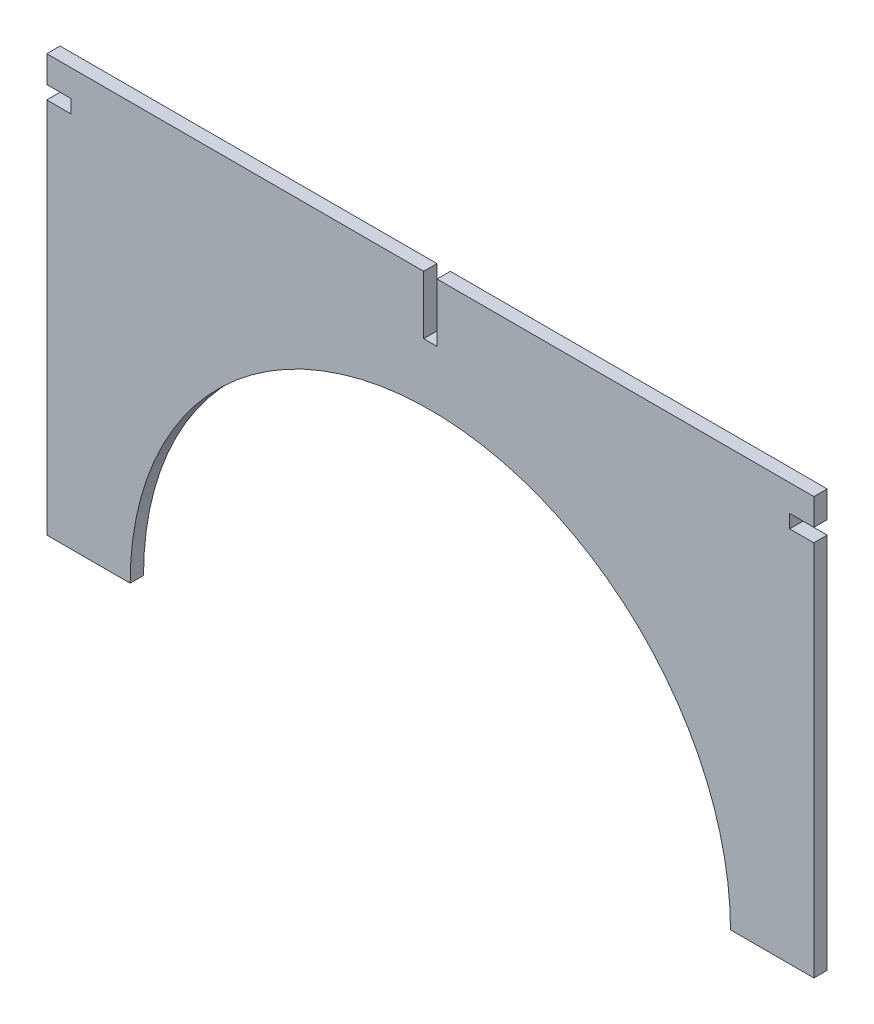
ISO-10303-21;
HEADER;
FILE_DESCRIPTION(('STEP AP214'),'2;1');
FILE_NAME('part.step','',(''),(''),'','','');
FILE_SCHEMA(('AUTOMOTIVE_DESIGN { 1 0 10303 214 1 1 1 1 }'));
ENDSEC;
DATA;
#1=APPLICATION_CONTEXT('core data for automotive mechanical design processes');
#2=APPLICATION_PROTOCOL_DEFINITION('international standard','automotive_design',2000,#1);
#3=PRODUCT_CONTEXT('',#1,'mechanical');
#4=PRODUCT('Part','Part','',(#3));
#5=PRODUCT_RELATED_PRODUCT_CATEGORY('part','',(#4));
#6=PRODUCT_DEFINITION_FORMATION('','',#4);
#7=PRODUCT_DEFINITION_CONTEXT('part definition',#1,'design');
#8=PRODUCT_DEFINITION('design','',#6,#7);
#9=PRODUCT_DEFINITION_SHAPE('','',#8);
#10=(LENGTH_UNIT() NAMED_UNIT(*) SI_UNIT(.MILLI.,.METRE.));
#11=(NAMED_UNIT(*) PLANE_ANGLE_UNIT() SI_UNIT($,.RADIAN.));
#12=(NAMED_UNIT(*) SI_UNIT($,.STERADIAN.) SOLID_ANGLE_UNIT());
#13=UNCERTAINTY_MEASURE_WITH_UNIT(LENGTH_MEASURE(1.E-05),#10,'distance_accuracy_value','');
#14=(GEOMETRIC_REPRESENTATION_CONTEXT(3) GLOBAL_UNCERTAINTY_ASSIGNED_CONTEXT((#13)) GLOBAL_UNIT_ASSIGNED_CONTEXT((#10,
#11,#12)) REPRESENTATION_CONTEXT('',''));
#15=CARTESIAN_POINT('',(0.,0.,0.));
#16=DIRECTION('',(0.,0.,1.));
#17=DIRECTION('',(1.,0.,0.));
#18=AXIS2_PLACEMENT_3D('',#15,#16,#17);
#19=CARTESIAN_POINT('',(0.,0.,16.));
#20=DIRECTION('',(0.,0.,1.));
#21=DIRECTION('',(1.,0.,0.));
#22=AXIS2_PLACEMENT_3D('',#19,#20,#21);
#23=PLANE('',#22);
#24=DIRECTION('',(0.,-1.,0.));
#25=VECTOR('',#24,1.);
#26=CARTESIAN_POINT('',(490.926217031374,0.,16.));
#27=LINE('',#26,#25);
#28=CARTESIAN_POINT('',(490.926217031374,92.,16.));
#29=VERTEX_POINT('',#28);
#30=CARTESIAN_POINT('',(490.926217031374,-360.,16.));
#31=VERTEX_POINT('',#30);
#32=EDGE_CURVE('E182',#29,#31,#27,.T.);
#33=ORIENTED_EDGE('',*,*,#32,.F.);
#34=DIRECTION('',(1.,0.,0.));
#35=VECTOR('',#34,1.);
#36=CARTESIAN_POINT('',(490.926217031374,92.,16.));
#37=LINE('',#36,#35);
#38=CARTESIAN_POINT('',(461.926217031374,92.,16.));
#39=VERTEX_POINT('',#38);
#40=EDGE_CURVE('E171',#39,#29,#37,.T.);
#41=ORIENTED_EDGE('',*,*,#40,.F.);
#42=DIRECTION('',(0.,-1.,0.));
#43=VECTOR('',#42,1.);
#44=CARTESIAN_POINT('',(461.926217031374,108.,16.));
#45=LINE('',#44,#43);
#46=CARTESIAN_POINT('',(461.926217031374,108.,16.));
#47=VERTEX_POINT('',#46);
#48=EDGE_CURVE('E161',#47,#39,#45,.T.);
#49=ORIENTED_EDGE('',*,*,#48,.F.);
#50=DIRECTION('',(-1.,0.,0.));
#51=VECTOR('',#50,1.);
#52=CARTESIAN_POINT('',(490.926217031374,108.,16.));
#53=LINE('',#52,#51);
#54=CARTESIAN_POINT('',(490.926217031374,108.,16.));
#55=VERTEX_POINT('',#54);
#56=EDGE_CURVE('E183',#55,#47,#53,.T.);
#57=ORIENTED_EDGE('',*,*,#56,.F.);
#58=CARTESIAN_POINT('',(490.926217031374,140.,16.));
#59=VERTEX_POINT('',#58);
#60=EDGE_CURVE('E225',#59,#55,#27,.T.);
#61=ORIENTED_EDGE('',*,*,#60,.F.);
#62=DIRECTION('',(-1.,0.,0.));
#63=VECTOR('',#62,1.);
#64=CARTESIAN_POINT('',(0.,140.,16.));
#65=LINE('',#64,#63);
#66=CARTESIAN_POINT('',(38.9262170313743,140.,16.));
#67=VERTEX_POINT('',#66);
#68=EDGE_CURVE('E228',#59,#67,#65,.T.);
#69=ORIENTED_EDGE('',*,*,#68,.T.);
#70=DIRECTION('',(0.,1.,0.));
#71=VECTOR('',#70,1.);
#72=CARTESIAN_POINT('',(38.9262170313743,0.,16.));
#73=LINE('',#72,#71);
#74=CARTESIAN_POINT('',(38.9262170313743,70.,16.));
#75=VERTEX_POINT('',#74);
#76=EDGE_CURVE('E230',#75,#67,#73,.T.);
#77=ORIENTED_EDGE('',*,*,#76,.F.);
#78=DIRECTION('',(1.,0.,0.));
#79=VECTOR('',#78,1.);
#80=CARTESIAN_POINT('',(0.,70.,16.));
#81=LINE('',#80,#79);
#82=CARTESIAN_POINT('',(22.9262170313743,70.,16.));
#83=VERTEX_POINT('',#82);
#84=EDGE_CURVE('E234',#83,#75,#81,.T.);
#85=ORIENTED_EDGE('',*,*,#84,.F.);
#86=DIRECTION('',(0.,1.,0.));
#87=VECTOR('',#86,1.);
#88=CARTESIAN_POINT('',(22.9262170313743,0.,16.));
#89=LINE('',#88,#87);
#90=CARTESIAN_POINT('',(22.9262170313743,140.,16.));
#91=VERTEX_POINT('',#90);
#92=EDGE_CURVE('E237',#83,#91,#89,.T.);
#93=ORIENTED_EDGE('',*,*,#92,.T.);
#94=CARTESIAN_POINT('',(-429.073782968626,140.,16.));
#95=VERTEX_POINT('',#94);
#96=EDGE_CURVE('E231',#91,#95,#65,.T.);
#97=ORIENTED_EDGE('',*,*,#96,.T.);
#98=DIRECTION('',(0.,-1.,0.));
#99=VECTOR('',#98,1.);
#100=CARTESIAN_POINT('',(-429.073782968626,0.,16.));
#101=LINE('',#100,#99);
#102=CARTESIAN_POINT('',(-429.073782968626,108.,16.));
#103=VERTEX_POINT('',#102);
#104=EDGE_CURVE('E239',#95,#103,#101,.T.);
#105=ORIENTED_EDGE('',*,*,#104,.T.);
#106=DIRECTION('',(-1.,0.,0.));
#107=VECTOR('',#106,1.);
#108=CARTESIAN_POINT('',(-429.073782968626,108.,16.));
#109=LINE('',#108,#107);
#110=CARTESIAN_POINT('',(-400.073782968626,108.,16.));
#111=VERTEX_POINT('',#110);
#112=EDGE_CURVE('E197',#111,#103,#109,.T.);
#113=ORIENTED_EDGE('',*,*,#112,.F.);
#114=DIRECTION('',(0.,1.,0.));
#115=VECTOR('',#114,1.);
#116=CARTESIAN_POINT('',(-400.073782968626,108.,16.));
#117=LINE('',#116,#115);
#118=CARTESIAN_POINT('',(-400.073782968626,92.,16.));
#119=VERTEX_POINT('',#118);
#120=EDGE_CURVE('E195',#119,#111,#117,.T.);
#121=ORIENTED_EDGE('',*,*,#120,.F.);
#122=DIRECTION('',(1.,0.,0.));
#123=VECTOR('',#122,1.);
#124=CARTESIAN_POINT('',(-429.073782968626,92.,16.));
#125=LINE('',#124,#123);
#126=CARTESIAN_POINT('',(-429.073782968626,92.,16.));
#127=VERTEX_POINT('',#126);
#128=EDGE_CURVE('E200',#127,#119,#125,.T.);
#129=ORIENTED_EDGE('',*,*,#128,.F.);
#130=CARTESIAN_POINT('',(-429.073782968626,-360.,16.));
#131=VERTEX_POINT('',#130);
#132=EDGE_CURVE('E243',#127,#131,#101,.T.);
#133=ORIENTED_EDGE('',*,*,#132,.T.);
#134=DIRECTION('',(-1.,0.,0.));
#135=VECTOR('',#134,1.);
#136=CARTESIAN_POINT('',(3.99680288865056E-13,-360.,16.));
#137=LINE('',#136,#135);
#138=CARTESIAN_POINT('',(-329.073782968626,-360.,16.));
#139=VERTEX_POINT('',#138);
#140=EDGE_CURVE('E242',#139,#131,#137,.T.);
#141=ORIENTED_EDGE('',*,*,#140,.F.);
#142=CARTESIAN_POINT('',(30.9262170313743,-360.,16.));
#143=DIRECTION('',(0.,0.,1.));
#144=DIRECTION('',(1.,0.,0.));
#145=AXIS2_PLACEMENT_3D('',#142,#143,#144);
#146=CIRCLE('',#145,360.);
#147=CARTESIAN_POINT('',(390.926217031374,-360.,16.));
#148=VERTEX_POINT('',#147);
#149=EDGE_CURVE('E218',#148,#139,#146,.T.);
#150=ORIENTED_EDGE('',*,*,#149,.F.);
#151=DIRECTION('',(-1.,0.,0.));
#152=VECTOR('',#151,1.);
#153=CARTESIAN_POINT('',(1.99840144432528E-13,-360.,16.));
#154=LINE('',#153,#152);
#155=EDGE_CURVE('E221',#31,#148,#154,.T.);
#156=ORIENTED_EDGE('',*,*,#155,.F.);
#157=EDGE_LOOP('',(#33,#41,#49,#57,#61,#69,#77,#85,#93,#97,#105,#113,#121,#129,#133,#141,#150,#156));
#158=FACE_BOUND('',#157,.T.);
#159=ADVANCED_FACE('F34',(#158),#23,.T.);
#160=CARTESIAN_POINT('',(0.,0.,0.));
#161=DIRECTION('',(0.,0.,1.));
#162=DIRECTION('',(1.,0.,0.));
#163=AXIS2_PLACEMENT_3D('',#160,#161,#162);
#164=PLANE('',#163);
#165=DIRECTION('',(1.,0.,0.));
#166=VECTOR('',#165,1.);
#167=CARTESIAN_POINT('',(490.926217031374,92.,0.));
#168=LINE('',#167,#166);
#169=CARTESIAN_POINT('',(461.926217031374,92.,0.));
#170=VERTEX_POINT('',#169);
#171=CARTESIAN_POINT('',(490.926217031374,92.,0.));
#172=VERTEX_POINT('',#171);
#173=EDGE_CURVE('E177',#170,#172,#168,.T.);
#174=ORIENTED_EDGE('',*,*,#173,.T.);
#175=DIRECTION('',(0.,-1.,0.));
#176=VECTOR('',#175,1.);
#177=CARTESIAN_POINT('',(490.926217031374,0.,0.));
#178=LINE('',#177,#176);
#179=CARTESIAN_POINT('',(490.926217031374,-360.,0.));
#180=VERTEX_POINT('',#179);
#181=EDGE_CURVE('E252',#172,#180,#178,.T.);
#182=ORIENTED_EDGE('',*,*,#181,.T.);
#183=DIRECTION('',(-1.,0.,0.));
#184=VECTOR('',#183,1.);
#185=CARTESIAN_POINT('',(1.99840144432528E-13,-360.,0.));
#186=LINE('',#185,#184);
#187=CARTESIAN_POINT('',(390.926217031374,-360.,0.));
#188=VERTEX_POINT('',#187);
#189=EDGE_CURVE('E249',#180,#188,#186,.T.);
#190=ORIENTED_EDGE('',*,*,#189,.T.);
#191=CARTESIAN_POINT('',(30.9262170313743,-360.,0.));
#192=DIRECTION('',(0.,0.,1.));
#193=DIRECTION('',(1.,0.,0.));
#194=AXIS2_PLACEMENT_3D('',#191,#192,#193);
#195=CIRCLE('',#194,360.);
#196=CARTESIAN_POINT('',(-329.073782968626,-360.,0.));
#197=VERTEX_POINT('',#196);
#198=EDGE_CURVE('E217',#188,#197,#195,.T.);
#199=ORIENTED_EDGE('',*,*,#198,.T.);
#200=DIRECTION('',(-1.,0.,0.));
#201=VECTOR('',#200,1.);
#202=CARTESIAN_POINT('',(3.99680288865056E-13,-360.,0.));
#203=LINE('',#202,#201);
#204=CARTESIAN_POINT('',(-429.073782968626,-360.,0.));
#205=VERTEX_POINT('',#204);
#206=EDGE_CURVE('E222',#197,#205,#203,.T.);
#207=ORIENTED_EDGE('',*,*,#206,.T.);
#208=DIRECTION('',(0.,-1.,0.));
#209=VECTOR('',#208,1.);
#210=CARTESIAN_POINT('',(-429.073782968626,0.,0.));
#211=LINE('',#210,#209);
#212=CARTESIAN_POINT('',(-429.073782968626,92.,0.));
#213=VERTEX_POINT('',#212);
#214=EDGE_CURVE('E271',#213,#205,#211,.T.);
#215=ORIENTED_EDGE('',*,*,#214,.F.);
#216=DIRECTION('',(1.,0.,0.));
#217=VECTOR('',#216,1.);
#218=CARTESIAN_POINT('',(-429.073782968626,92.,0.));
#219=LINE('',#218,#217);
#220=CARTESIAN_POINT('',(-400.073782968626,92.,0.));
#221=VERTEX_POINT('',#220);
#222=EDGE_CURVE('E198',#213,#221,#219,.T.);
#223=ORIENTED_EDGE('',*,*,#222,.T.);
#224=DIRECTION('',(0.,1.,0.));
#225=VECTOR('',#224,1.);
#226=CARTESIAN_POINT('',(-400.073782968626,108.,0.));
#227=LINE('',#226,#225);
#228=CARTESIAN_POINT('',(-400.073782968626,108.,0.));
#229=VERTEX_POINT('',#228);
#230=EDGE_CURVE('E57',#221,#229,#227,.T.);
#231=ORIENTED_EDGE('',*,*,#230,.T.);
#232=DIRECTION('',(-1.,0.,0.));
#233=VECTOR('',#232,1.);
#234=CARTESIAN_POINT('',(-429.073782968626,108.,0.));
#235=LINE('',#234,#233);
#236=CARTESIAN_POINT('',(-429.073782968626,108.,0.));
#237=VERTEX_POINT('',#236);
#238=EDGE_CURVE('E204',#229,#237,#235,.T.);
#239=ORIENTED_EDGE('',*,*,#238,.T.);
#240=CARTESIAN_POINT('',(-429.073782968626,140.,0.));
#241=VERTEX_POINT('',#240);
#242=EDGE_CURVE('E268',#241,#237,#211,.T.);
#243=ORIENTED_EDGE('',*,*,#242,.F.);
#244=DIRECTION('',(-1.,0.,0.));
#245=VECTOR('',#244,1.);
#246=CARTESIAN_POINT('',(0.,140.,0.));
#247=LINE('',#246,#245);
#248=CARTESIAN_POINT('',(22.9262170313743,140.,0.));
#249=VERTEX_POINT('',#248);
#250=EDGE_CURVE('E260',#249,#241,#247,.T.);
#251=ORIENTED_EDGE('',*,*,#250,.F.);
#252=DIRECTION('',(0.,1.,0.));
#253=VECTOR('',#252,1.);
#254=CARTESIAN_POINT('',(22.9262170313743,0.,0.));
#255=LINE('',#254,#253);
#256=CARTESIAN_POINT('',(22.9262170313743,70.,0.));
#257=VERTEX_POINT('',#256);
#258=EDGE_CURVE('E266',#257,#249,#255,.T.);
#259=ORIENTED_EDGE('',*,*,#258,.F.);
#260=DIRECTION('',(1.,0.,0.));
#261=VECTOR('',#260,1.);
#262=CARTESIAN_POINT('',(0.,70.,0.));
#263=LINE('',#262,#261);
#264=CARTESIAN_POINT('',(38.9262170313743,70.,0.));
#265=VERTEX_POINT('',#264);
#266=EDGE_CURVE('E263',#257,#265,#263,.T.);
#267=ORIENTED_EDGE('',*,*,#266,.T.);
#268=DIRECTION('',(0.,1.,0.));
#269=VECTOR('',#268,1.);
#270=CARTESIAN_POINT('',(38.9262170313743,0.,0.));
#271=LINE('',#270,#269);
#272=CARTESIAN_POINT('',(38.9262170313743,140.,0.));
#273=VERTEX_POINT('',#272);
#274=EDGE_CURVE('E259',#265,#273,#271,.T.);
#275=ORIENTED_EDGE('',*,*,#274,.T.);
#276=CARTESIAN_POINT('',(490.926217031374,140.,0.));
#277=VERTEX_POINT('',#276);
#278=EDGE_CURVE('E256',#277,#273,#247,.T.);
#279=ORIENTED_EDGE('',*,*,#278,.F.);
#280=CARTESIAN_POINT('',(490.926217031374,108.,0.));
#281=VERTEX_POINT('',#280);
#282=EDGE_CURVE('E253',#277,#281,#178,.T.);
#283=ORIENTED_EDGE('',*,*,#282,.T.);
#284=DIRECTION('',(-1.,0.,0.));
#285=VECTOR('',#284,1.);
#286=CARTESIAN_POINT('',(490.926217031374,108.,0.));
#287=LINE('',#286,#285);
#288=CARTESIAN_POINT('',(461.926217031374,108.,0.));
#289=VERTEX_POINT('',#288);
#290=EDGE_CURVE('E49',#281,#289,#287,.T.);
#291=ORIENTED_EDGE('',*,*,#290,.T.);
#292=DIRECTION('',(0.,-1.,0.));
#293=VECTOR('',#292,1.);
#294=CARTESIAN_POINT('',(461.926217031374,108.,0.));
#295=LINE('',#294,#293);
#296=EDGE_CURVE('E187',#289,#170,#295,.T.);
#297=ORIENTED_EDGE('',*,*,#296,.T.);
#298=EDGE_LOOP('',(#174,#182,#190,#199,#207,#215,#223,#231,#239,#243,#251,#259,#267,#275,#279,
#283,#291,#297));
#299=FACE_BOUND('',#298,.T.);
#300=ADVANCED_FACE('F301',(#299),#164,.F.);
#301=CARTESIAN_POINT('',(490.926217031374,0.,16.));
#302=DIRECTION('',(1.,0.,0.));
#303=DIRECTION('',(0.,1.,0.));
#304=AXIS2_PLACEMENT_3D('',#301,#302,#303);
#305=PLANE('',#304);
#306=ORIENTED_EDGE('',*,*,#181,.F.);
#307=DIRECTION('',(0.,0.,-1.));
#308=VECTOR('',#307,1.);
#309=CARTESIAN_POINT('',(490.926217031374,92.,16.));
#310=LINE('',#309,#308);
#311=EDGE_CURVE('E178',#29,#172,#310,.T.);
#312=ORIENTED_EDGE('',*,*,#311,.F.);
#313=ORIENTED_EDGE('',*,*,#32,.T.);
#314=DIRECTION('',(0.,0.,-1.));
#315=VECTOR('',#314,1.);
#316=CARTESIAN_POINT('',(490.926217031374,-360.,16.));
#317=LINE('',#316,#315);
#318=EDGE_CURVE('E42',#31,#180,#317,.T.);
#319=ORIENTED_EDGE('',*,*,#318,.T.);
#320=EDGE_LOOP('',(#306,#312,#313,#319));
#321=FACE_BOUND('',#320,.T.);
#322=ADVANCED_FACE('F296',(#321),#305,.T.);
#323=ORIENTED_EDGE('',*,*,#60,.T.);
#324=DIRECTION('',(0.,0.,-1.));
#325=VECTOR('',#324,1.);
#326=CARTESIAN_POINT('',(490.926217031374,108.,16.));
#327=LINE('',#326,#325);
#328=EDGE_CURVE('E192',#55,#281,#327,.T.);
#329=ORIENTED_EDGE('',*,*,#328,.T.);
#330=ORIENTED_EDGE('',*,*,#282,.F.);
#331=DIRECTION('',(0.,0.,-1.));
#332=VECTOR('',#331,1.);
#333=CARTESIAN_POINT('',(490.926217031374,140.,16.));
#334=LINE('',#333,#332);
#335=EDGE_CURVE('E290',#59,#277,#334,.T.);
#336=ORIENTED_EDGE('',*,*,#335,.F.);
#337=EDGE_LOOP('',(#323,#329,#330,#336));
#338=FACE_BOUND('',#337,.T.);
#339=ADVANCED_FACE('F306',(#338),#305,.T.);
#340=CARTESIAN_POINT('',(-429.073782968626,0.,16.));
#341=DIRECTION('',(1.,0.,0.));
#342=DIRECTION('',(0.,1.,0.));
#343=AXIS2_PLACEMENT_3D('',#340,#341,#342);
#344=PLANE('',#343);
#345=DIRECTION('',(0.,0.,-1.));
#346=VECTOR('',#345,1.);
#347=CARTESIAN_POINT('',(-429.073782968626,108.,16.));
#348=LINE('',#347,#346);
#349=EDGE_CURVE('E213',#103,#237,#348,.T.);
#350=ORIENTED_EDGE('',*,*,#349,.F.);
#351=ORIENTED_EDGE('',*,*,#104,.F.);
#352=DIRECTION('',(0.,0.,-1.));
#353=VECTOR('',#352,1.);
#354=CARTESIAN_POINT('',(-429.073782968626,140.,16.));
#355=LINE('',#354,#353);
#356=EDGE_CURVE('E278',#95,#241,#355,.T.);
#357=ORIENTED_EDGE('',*,*,#356,.T.);
#358=ORIENTED_EDGE('',*,*,#242,.T.);
#359=EDGE_LOOP('',(#350,#351,#357,#358));
#360=FACE_BOUND('',#359,.T.);
#361=ADVANCED_FACE('F349',(#360),#344,.F.);
#362=DIRECTION('',(0.,0.,-1.));
#363=VECTOR('',#362,1.);
#364=CARTESIAN_POINT('',(-429.073782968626,92.,16.));
#365=LINE('',#364,#363);
#366=EDGE_CURVE('E210',#127,#213,#365,.T.);
#367=ORIENTED_EDGE('',*,*,#366,.T.);
#368=ORIENTED_EDGE('',*,*,#214,.T.);
#369=DIRECTION('',(0.,0.,-1.));
#370=VECTOR('',#369,1.);
#371=CARTESIAN_POINT('',(-429.073782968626,-360.,16.));
#372=LINE('',#371,#370);
#373=EDGE_CURVE('E275',#131,#205,#372,.T.);
#374=ORIENTED_EDGE('',*,*,#373,.F.);
#375=ORIENTED_EDGE('',*,*,#132,.F.);
#376=EDGE_LOOP('',(#367,#368,#374,#375));
#377=FACE_BOUND('',#376,.T.);
#378=ADVANCED_FACE('F339',(#377),#344,.F.);
#379=CARTESIAN_POINT('',(30.9262170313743,-360.,16.));
#380=DIRECTION('',(0.,0.,-1.));
#381=DIRECTION('',(-1.,0.,0.));
#382=AXIS2_PLACEMENT_3D('',#379,#380,#381);
#383=CYLINDRICAL_SURFACE('',#382,360.);
#384=ORIENTED_EDGE('',*,*,#198,.F.);
#385=DIRECTION('',(0.,0.,-1.));
#386=VECTOR('',#385,1.);
#387=CARTESIAN_POINT('',(390.926217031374,-360.,16.));
#388=LINE('',#387,#386);
#389=EDGE_CURVE('E11',#148,#188,#388,.T.);
#390=ORIENTED_EDGE('',*,*,#389,.F.);
#391=ORIENTED_EDGE('',*,*,#149,.T.);
#392=DIRECTION('',(0.,0.,-1.));
#393=VECTOR('',#392,1.);
#394=CARTESIAN_POINT('',(-329.073782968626,-360.,16.));
#395=LINE('',#394,#393);
#396=EDGE_CURVE('E246',#139,#197,#395,.T.);
#397=ORIENTED_EDGE('',*,*,#396,.T.);
#398=EDGE_LOOP('',(#384,#390,#391,#397));
#399=FACE_BOUND('',#398,.T.);
#400=ADVANCED_FACE('F36',(#399),#383,.F.);
#401=CARTESIAN_POINT('',(1.99840144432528E-13,-360.,16.));
#402=DIRECTION('',(0.,-1.,0.));
#403=DIRECTION('',(1.,0.,0.));
#404=AXIS2_PLACEMENT_3D('',#401,#402,#403);
#405=PLANE('',#404);
#406=ORIENTED_EDGE('',*,*,#189,.F.);
#407=ORIENTED_EDGE('',*,*,#318,.F.);
#408=ORIENTED_EDGE('',*,*,#155,.T.);
#409=ORIENTED_EDGE('',*,*,#389,.T.);
#410=EDGE_LOOP('',(#406,#407,#408,#409));
#411=FACE_BOUND('',#410,.T.);
#412=ADVANCED_FACE('F298',(#411),#405,.T.);
#413=CARTESIAN_POINT('',(0.,140.,16.));
#414=DIRECTION('',(0.,-1.,0.));
#415=DIRECTION('',(1.,0.,0.));
#416=AXIS2_PLACEMENT_3D('',#413,#414,#415);
#417=PLANE('',#416);
#418=ORIENTED_EDGE('',*,*,#278,.T.);
#419=DIRECTION('',(0.,0.,-1.));
#420=VECTOR('',#419,1.);
#421=CARTESIAN_POINT('',(38.9262170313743,140.,16.));
#422=LINE('',#421,#420);
#423=EDGE_CURVE('E288',#67,#273,#422,.T.);
#424=ORIENTED_EDGE('',*,*,#423,.F.);
#425=ORIENTED_EDGE('',*,*,#68,.F.);
#426=ORIENTED_EDGE('',*,*,#335,.T.);
#427=EDGE_LOOP('',(#418,#424,#425,#426));
#428=FACE_BOUND('',#427,.T.);
#429=ADVANCED_FACE('F314',(#428),#417,.F.);
#430=CARTESIAN_POINT('',(38.9262170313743,0.,16.));
#431=DIRECTION('',(-1.,0.,0.));
#432=DIRECTION('',(0.,-1.,0.));
#433=AXIS2_PLACEMENT_3D('',#430,#431,#432);
#434=PLANE('',#433);
#435=ORIENTED_EDGE('',*,*,#274,.F.);
#436=DIRECTION('',(0.,0.,-1.));
#437=VECTOR('',#436,1.);
#438=CARTESIAN_POINT('',(38.9262170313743,70.,16.));
#439=LINE('',#438,#437);
#440=EDGE_CURVE('E286',#75,#265,#439,.T.);
#441=ORIENTED_EDGE('',*,*,#440,.F.);
#442=ORIENTED_EDGE('',*,*,#76,.T.);
#443=ORIENTED_EDGE('',*,*,#423,.T.);
#444=EDGE_LOOP('',(#435,#441,#442,#443));
#445=FACE_BOUND('',#444,.T.);
#446=ADVANCED_FACE('F317',(#445),#434,.T.);
#447=CARTESIAN_POINT('',(0.,70.,16.));
#448=DIRECTION('',(0.,1.,0.));
#449=DIRECTION('',(0.,0.,1.));
#450=AXIS2_PLACEMENT_3D('',#447,#448,#449);
#451=PLANE('',#450);
#452=ORIENTED_EDGE('',*,*,#266,.F.);
#453=DIRECTION('',(0.,0.,-1.));
#454=VECTOR('',#453,1.);
#455=CARTESIAN_POINT('',(22.9262170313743,70.,16.));
#456=LINE('',#455,#454);
#457=EDGE_CURVE('E284',#83,#257,#456,.T.);
#458=ORIENTED_EDGE('',*,*,#457,.F.);
#459=ORIENTED_EDGE('',*,*,#84,.T.);
#460=ORIENTED_EDGE('',*,*,#440,.T.);
#461=EDGE_LOOP('',(#452,#458,#459,#460));
#462=FACE_BOUND('',#461,.T.);
#463=ADVANCED_FACE('F320',(#462),#451,.T.);
#464=CARTESIAN_POINT('',(22.9262170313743,0.,16.));
#465=DIRECTION('',(-1.,0.,0.));
#466=DIRECTION('',(0.,-1.,0.));
#467=AXIS2_PLACEMENT_3D('',#464,#465,#466);
#468=PLANE('',#467);
#469=ORIENTED_EDGE('',*,*,#258,.T.);
#470=DIRECTION('',(0.,0.,-1.));
#471=VECTOR('',#470,1.);
#472=CARTESIAN_POINT('',(22.9262170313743,140.,16.));
#473=LINE('',#472,#471);
#474=EDGE_CURVE('E281',#91,#249,#473,.T.);
#475=ORIENTED_EDGE('',*,*,#474,.F.);
#476=ORIENTED_EDGE('',*,*,#92,.F.);
#477=ORIENTED_EDGE('',*,*,#457,.T.);
#478=EDGE_LOOP('',(#469,#475,#476,#477));
#479=FACE_BOUND('',#478,.T.);
#480=ADVANCED_FACE('F326',(#479),#468,.F.);
#481=ORIENTED_EDGE('',*,*,#250,.T.);
#482=ORIENTED_EDGE('',*,*,#356,.F.);
#483=ORIENTED_EDGE('',*,*,#96,.F.);
#484=ORIENTED_EDGE('',*,*,#474,.T.);
#485=EDGE_LOOP('',(#481,#482,#483,#484));
#486=FACE_BOUND('',#485,.T.);
#487=ADVANCED_FACE('F330',(#486),#417,.F.);
#488=CARTESIAN_POINT('',(3.99680288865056E-13,-360.,16.));
#489=DIRECTION('',(0.,-1.,0.));
#490=DIRECTION('',(1.,0.,0.));
#491=AXIS2_PLACEMENT_3D('',#488,#489,#490);
#492=PLANE('',#491);
#493=ORIENTED_EDGE('',*,*,#206,.F.);
#494=ORIENTED_EDGE('',*,*,#396,.F.);
#495=ORIENTED_EDGE('',*,*,#140,.T.);
#496=ORIENTED_EDGE('',*,*,#373,.T.);
#497=EDGE_LOOP('',(#493,#494,#495,#496));
#498=FACE_BOUND('',#497,.T.);
#499=ADVANCED_FACE('F342',(#498),#492,.T.);
#500=CARTESIAN_POINT('',(-400.073782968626,108.,16.));
#501=DIRECTION('',(-1.,0.,0.));
#502=DIRECTION('',(0.,0.,1.));
#503=AXIS2_PLACEMENT_3D('',#500,#501,#502);
#504=PLANE('',#503);
#505=ORIENTED_EDGE('',*,*,#230,.F.);
#506=DIRECTION('',(0.,0.,-1.));
#507=VECTOR('',#506,1.);
#508=CARTESIAN_POINT('',(-400.073782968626,92.,16.));
#509=LINE('',#508,#507);
#510=EDGE_CURVE('E202',#119,#221,#509,.T.);
#511=ORIENTED_EDGE('',*,*,#510,.F.);
#512=ORIENTED_EDGE('',*,*,#120,.T.);
#513=DIRECTION('',(0.,0.,-1.));
#514=VECTOR('',#513,1.);
#515=CARTESIAN_POINT('',(-400.073782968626,108.,16.));
#516=LINE('',#515,#514);
#517=EDGE_CURVE('E215',#111,#229,#516,.T.);
#518=ORIENTED_EDGE('',*,*,#517,.T.);
#519=EDGE_LOOP('',(#505,#511,#512,#518));
#520=FACE_BOUND('',#519,.T.);
#521=ADVANCED_FACE('F359',(#520),#504,.T.);
#522=CARTESIAN_POINT('',(-429.073782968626,108.,16.));
#523=DIRECTION('',(0.,-1.,0.));
#524=DIRECTION('',(1.,0.,0.));
#525=AXIS2_PLACEMENT_3D('',#522,#523,#524);
#526=PLANE('',#525);
#527=ORIENTED_EDGE('',*,*,#238,.F.);
#528=ORIENTED_EDGE('',*,*,#517,.F.);
#529=ORIENTED_EDGE('',*,*,#112,.T.);
#530=ORIENTED_EDGE('',*,*,#349,.T.);
#531=EDGE_LOOP('',(#527,#528,#529,#530));
#532=FACE_BOUND('',#531,.T.);
#533=ADVANCED_FACE('F399',(#532),#526,.T.);
#534=CARTESIAN_POINT('',(-429.073782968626,92.,16.));
#535=DIRECTION('',(0.,1.,0.));
#536=DIRECTION('',(0.,0.,1.));
#537=AXIS2_PLACEMENT_3D('',#534,#535,#536);
#538=PLANE('',#537);
#539=ORIENTED_EDGE('',*,*,#222,.F.);
#540=ORIENTED_EDGE('',*,*,#366,.F.);
#541=ORIENTED_EDGE('',*,*,#128,.T.);
#542=ORIENTED_EDGE('',*,*,#510,.T.);
#543=EDGE_LOOP('',(#539,#540,#541,#542));
#544=FACE_BOUND('',#543,.T.);
#545=ADVANCED_FACE('F408',(#544),#538,.T.);
#546=CARTESIAN_POINT('',(461.926217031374,108.,16.));
#547=DIRECTION('',(1.,0.,0.));
#548=DIRECTION('',(0.,0.,-1.));
#549=AXIS2_PLACEMENT_3D('',#546,#547,#548);
#550=PLANE('',#549);
#551=ORIENTED_EDGE('',*,*,#296,.F.);
#552=DIRECTION('',(0.,0.,-1.));
#553=VECTOR('',#552,1.);
#554=CARTESIAN_POINT('',(461.926217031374,108.,16.));
#555=LINE('',#554,#553);
#556=EDGE_CURVE('E167',#47,#289,#555,.T.);
#557=ORIENTED_EDGE('',*,*,#556,.F.);
#558=ORIENTED_EDGE('',*,*,#48,.T.);
#559=DIRECTION('',(0.,0.,-1.));
#560=VECTOR('',#559,1.);
#561=CARTESIAN_POINT('',(461.926217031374,92.,16.));
#562=LINE('',#561,#560);
#563=EDGE_CURVE('E165',#39,#170,#562,.T.);
#564=ORIENTED_EDGE('',*,*,#563,.T.);
#565=EDGE_LOOP('',(#551,#557,#558,#564));
#566=FACE_BOUND('',#565,.T.);
#567=ADVANCED_FACE('F164',(#566),#550,.T.);
#568=CARTESIAN_POINT('',(490.926217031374,92.,16.));
#569=DIRECTION('',(0.,1.,0.));
#570=DIRECTION('',(-1.,0.,0.));
#571=AXIS2_PLACEMENT_3D('',#568,#569,#570);
#572=PLANE('',#571);
#573=ORIENTED_EDGE('',*,*,#173,.F.);
#574=ORIENTED_EDGE('',*,*,#563,.F.);
#575=ORIENTED_EDGE('',*,*,#40,.T.);
#576=ORIENTED_EDGE('',*,*,#311,.T.);
#577=EDGE_LOOP('',(#573,#574,#575,#576));
#578=FACE_BOUND('',#577,.T.);
#579=ADVANCED_FACE('F174',(#578),#572,.T.);
#580=CARTESIAN_POINT('',(490.926217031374,108.,16.));
#581=DIRECTION('',(0.,-1.,0.));
#582=DIRECTION('',(0.,0.,-1.));
#583=AXIS2_PLACEMENT_3D('',#580,#581,#582);
#584=PLANE('',#583);
#585=ORIENTED_EDGE('',*,*,#290,.F.);
#586=ORIENTED_EDGE('',*,*,#328,.F.);
#587=ORIENTED_EDGE('',*,*,#56,.T.);
#588=ORIENTED_EDGE('',*,*,#556,.T.);
#589=EDGE_LOOP('',(#585,#586,#587,#588));
#590=FACE_BOUND('',#589,.T.);
#591=ADVANCED_FACE('F309',(#590),#584,.T.);
#592=CLOSED_SHELL('',(#159,#300,#322,#339,#361,#378,#400,#412,#429,#446,#463,#480,#487,#499,
#521,#533,#545,#567,#579,#591));
#593=MANIFOLD_SOLID_BREP('B2',#592);
#594=ADVANCED_BREP_SHAPE_REPRESENTATION('',(#18,#593),#14);
#595=SHAPE_DEFINITION_REPRESENTATION(#9,#594);
ENDSEC;
END-ISO-10303-21;
